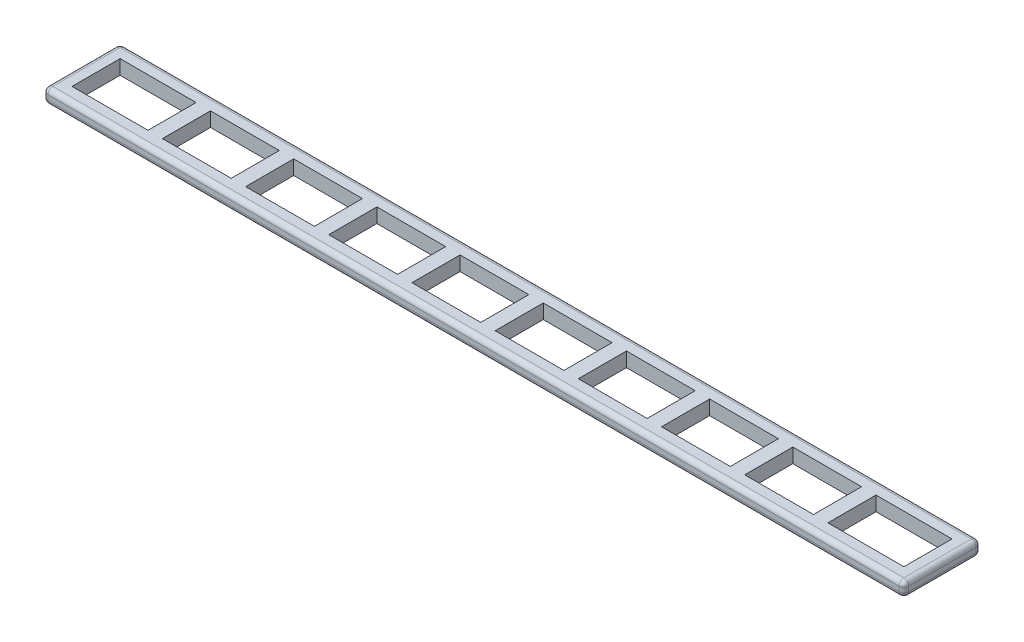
from build123d import *

# Parameters (mm, degrees)
SKETCH1_W               = 25.4
SKETCH1_H               = 4.7625
BOSS_EXTRUDE1_DEPTH     = 284.1625
CUT_EXTRUDE1_DEPTH      = 286.335185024
CUT_EXTRUDE1_DEPTH_BACK = 286.335185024
SKETCH2_W               = 274.6375
SKETCH2_H               = 15.875
SKETCH4_W               = 4.7625
SKETCH4_H               = 4.7625
BOSS_EXTRUDE2_DEPTH     = 15.875
FILLET1_R               = 1.5875


with BuildPart() as part:
    # Sketch1 → Boss-Extrude1 (new body)
    with BuildSketch(Plane(origin=(0, 0, 0), x_dir=(0, 0, -1), z_dir=(1, 0, 0))):
        with Locations((12.7, 2.38125)):
            Rectangle(SKETCH1_W, SKETCH1_H)
    extrude(amount=BOSS_EXTRUDE1_DEPTH)

    # Sketch2 → Cut-Extrude1 (cut, two sides: drawn at the far end of the back side and taken through both)
    with BuildSketch(Plane(origin=(0, 4.7625, 0), x_dir=(1, 0, 0), z_dir=(0, 1, 0)).offset(-CUT_EXTRUDE1_DEPTH_BACK)):
        with Locations((142.08125, 12.7)):
            Rectangle(SKETCH2_W, SKETCH2_H)
    extrude(amount=CUT_EXTRUDE1_DEPTH + CUT_EXTRUDE1_DEPTH_BACK, mode=Mode.SUBTRACT)

    # Sketch4 → Boss-Extrude2 (add)
    with BuildSketch(Plane.XY.offset(-20.6375)):
        with Locations((32.22625, 2.38125)):
            Rectangle(SKETCH4_W, SKETCH4_H)
        with Locations((59.69, 2.38125)):
            Rectangle(SKETCH4_W, SKETCH4_H)
        with Locations((87.15375, 2.38125)):
            Rectangle(SKETCH4_W, SKETCH4_H)
        with Locations((114.6175, 2.38125)):
            Rectangle(SKETCH4_W, SKETCH4_H)
        with Locations((142.08125, 2.38125)):
            Rectangle(SKETCH4_W, SKETCH4_H)
        with Locations((169.545, 2.38125)):
            Rectangle(SKETCH4_W, SKETCH4_H)
        with Locations((197.00875, 2.38125)):
            Rectangle(SKETCH4_W, SKETCH4_H)
        with Locations((224.4725, 2.38125)):
            Rectangle(SKETCH4_W, SKETCH4_H)
        with Locations((251.93625, 2.38125)):
            Rectangle(SKETCH4_W, SKETCH4_H)
    extrude(amount=BOSS_EXTRUDE2_DEPTH)

    # Fillet1
    fillet1_edges = [part.edges().sort_by_distance(p)[0] for p in [
        (284.1625, 2.38125, -25.4),
        (284.1625, 4.7625, -12.7),
        (284.1625, 2.38125, 0),
        (0, 4.7625, -12.7),
        (0, 2.38125, -25.4),
        (0, 0, -12.7),
        (0, 2.38125, 0),
        (284.1625, 0, -12.7),
        (142.08125, 4.7625, 0),
        (142.08125, 4.7625, -25.4),
        (142.08125, 0, -25.4),
        (142.08125, 0, 0),
    ]]
    fillet(fillet1_edges, radius=FILLET1_R)


solid = part.part
